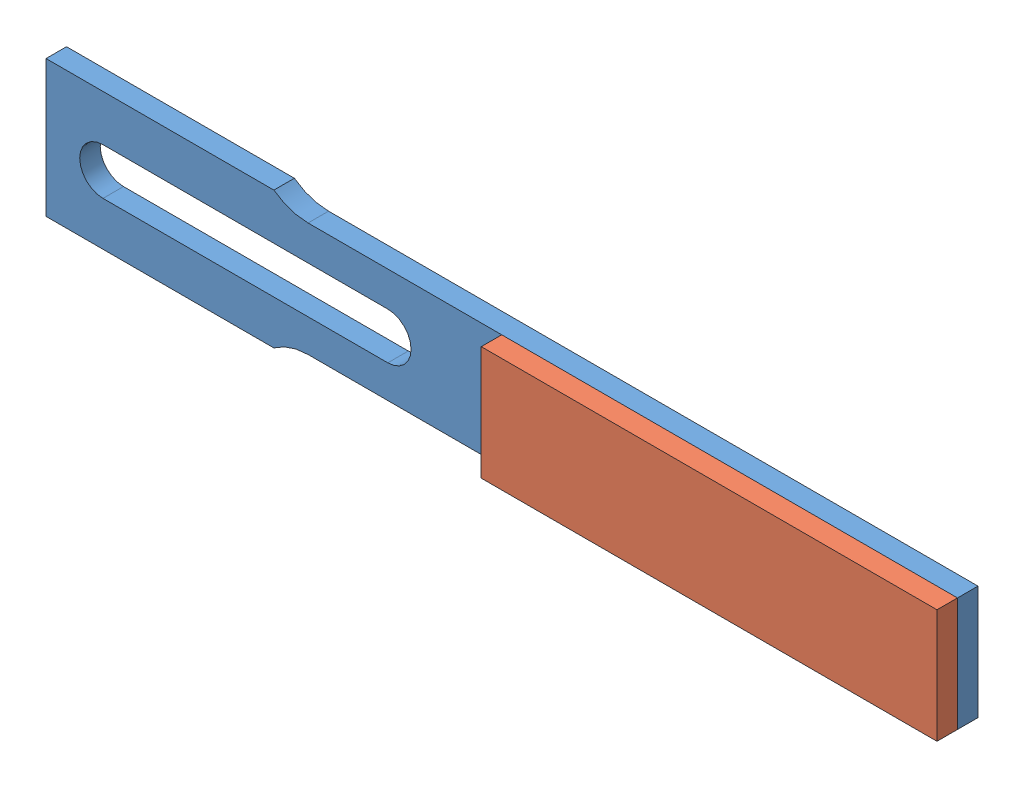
SolidWorks assembly BIMETAL PLATE.SLDASM, configuration Default (file format 3800). Lengths in mm.
Overall size (80 12 3.6).
2 component instances, 2 part files, 3 mates.
Components (placement in the parent):
- b01-1: b01.SLDPRT [Default] at origin size (80 12 1.8)
- b02-2: b02.SLDPRT [Default] at (40 0 1.8) size (40 10 1.8)
Mates (geometry in assembly coordinates):
- Coincident6: coincident anti-aligned: plane of b01-1 through (23 10 1.8) normal (0 0 1); plane of b02-2 through (40 5 1.8) normal (0 0 -1)
- Coincident7: coincident aligned: plane of b01-1 through (80 -5 1.8) normal (0 -1 0); plane of b02-2 through (40 -5 3.6) normal (0 -1 0)
- Coincident9: coincident aligned: plane of b01-1 through (80 -5 1.8) normal (1 0 0); plane of b02-2 through (80 5 3.6) normal (1 0 0)
